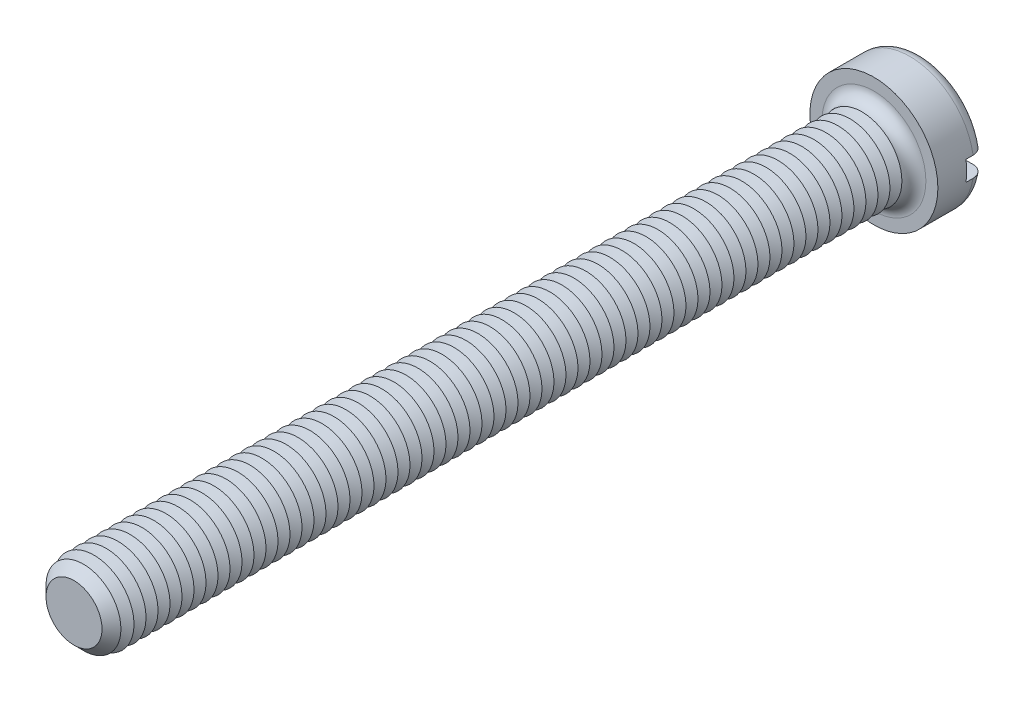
from build123d import *

# Parameters (mm, degrees)
SKETCH3_R           = 8
BOSS_EXTRUDE2_DEPTH = 6
SKETCH4_R           = 5
BOSS_EXTRUDE3_DEPTH = 100
FILLET1_R           = 1.5
CHAMFER1_SIZE       = 1.5
LPATTERN1_COUNT     = 65
LPATTERN1_PITCH     = 1.5
SKETCH8_W           = 16
SKETCH8_H           = 2.5
CUT_EXTRUDE1_DEPTH  = 2.4


with BuildPart() as part:
    # Sketch3 → Boss-Extrude2 (new body)
    with BuildSketch(Plane.XY):
        Circle(SKETCH3_R)
    extrude(amount=-BOSS_EXTRUDE2_DEPTH)

    # Sketch4 → Boss-Extrude3 (add)
    with BuildSketch(Plane.XY):
        Circle(SKETCH4_R)
    extrude(amount=BOSS_EXTRUDE3_DEPTH)

    # Fillet1
    fillet1_edges = [part.edges().sort_by_distance(p)[0] for p in [
        (-8, 0, -6),
        (-5, 0, 0),
    ]]
    fillet(fillet1_edges, radius=FILLET1_R)

    # Chamfer1
    chamfer1_edges = [part.edges().sort_by_distance(p)[0] for p in [
        (-5, 0, 100),
    ]]
    chamfer(chamfer1_edges, length=CHAMFER1_SIZE)

    # Sketch6 → Cut-Revolve1 (revolve, cut)
    with BuildSketch(Plane(origin=(0, 0, 0), x_dir=(0, 0, -1), z_dir=(1, 0, 0)), mode=Mode.PRIVATE) as cut_revolve1_sk:
        Polygon((-1.5, 5), (-2.25, 3.700961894), (-3, 5), align=None)
    cut_revolve1 = revolve(cut_revolve1_sk.sketch.rotate(Axis((0, 0, -1.694361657), (0, 0, 1)), 90), axis=Axis((0, 0, -1.694361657), (0, 0, 1)), mode=Mode.SUBTRACT)

    # LPattern1: Cut-Revolve1 ×65
    with Locations(*[(0, 0, i * LPATTERN1_PITCH) for i in range(1, LPATTERN1_COUNT)]):
        add(cut_revolve1, mode=Mode.SUBTRACT)

    # Sketch8 → Cut-Extrude1 (cut)
    with BuildSketch(Plane(origin=(0, 0, -6), x_dir=(-1, 0, 0), z_dir=(0, 0, -1))):
        Rectangle(SKETCH8_W, SKETCH8_H)
    extrude(amount=-CUT_EXTRUDE1_DEPTH, mode=Mode.SUBTRACT)


solid = part.part
